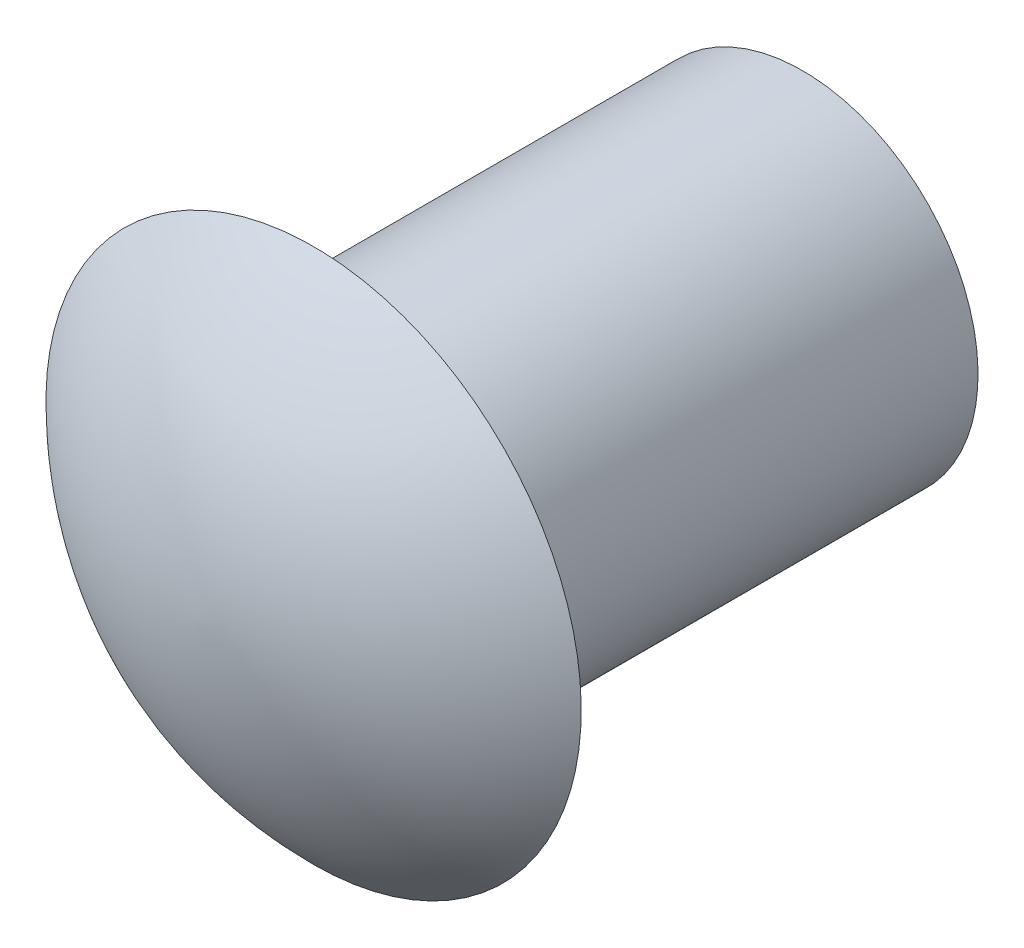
ISO-10303-21;
HEADER;
FILE_DESCRIPTION(('STEP AP214'),'2;1');
FILE_NAME('part.step','',(''),(''),'','','');
FILE_SCHEMA(('AUTOMOTIVE_DESIGN { 1 0 10303 214 1 1 1 1 }'));
ENDSEC;
DATA;
#1=APPLICATION_CONTEXT('core data for automotive mechanical design processes');
#2=APPLICATION_PROTOCOL_DEFINITION('international standard','automotive_design',2000,#1);
#3=PRODUCT_CONTEXT('',#1,'mechanical');
#4=PRODUCT('Part','Part','',(#3));
#5=PRODUCT_RELATED_PRODUCT_CATEGORY('part','',(#4));
#6=PRODUCT_DEFINITION_FORMATION('','',#4);
#7=PRODUCT_DEFINITION_CONTEXT('part definition',#1,'design');
#8=PRODUCT_DEFINITION('design','',#6,#7);
#9=PRODUCT_DEFINITION_SHAPE('','',#8);
#10=(LENGTH_UNIT() NAMED_UNIT(*) SI_UNIT(.MILLI.,.METRE.));
#11=(NAMED_UNIT(*) PLANE_ANGLE_UNIT() SI_UNIT($,.RADIAN.));
#12=(NAMED_UNIT(*) SI_UNIT($,.STERADIAN.) SOLID_ANGLE_UNIT());
#13=UNCERTAINTY_MEASURE_WITH_UNIT(LENGTH_MEASURE(1.E-05),#10,'distance_accuracy_value','');
#14=(GEOMETRIC_REPRESENTATION_CONTEXT(3) GLOBAL_UNCERTAINTY_ASSIGNED_CONTEXT((#13)) GLOBAL_UNIT_ASSIGNED_CONTEXT((#10,
#11,#12)) REPRESENTATION_CONTEXT('',''));
#15=CARTESIAN_POINT('',(0.,0.,0.));
#16=DIRECTION('',(0.,0.,1.));
#17=DIRECTION('',(1.,0.,0.));
#18=AXIS2_PLACEMENT_3D('',#15,#16,#17);
#19=CARTESIAN_POINT('',(0.,0.,-3.));
#20=DIRECTION('',(0.,0.,1.));
#21=DIRECTION('',(0.,1.,0.));
#22=AXIS2_PLACEMENT_3D('',#19,#20,#21);
#23=PLANE('',#22);
#24=CARTESIAN_POINT('',(0.,0.,-3.));
#25=DIRECTION('',(0.,0.,1.));
#26=DIRECTION('',(0.,-1.,0.));
#27=AXIS2_PLACEMENT_3D('',#24,#25,#26);
#28=CIRCLE('',#27,1.9);
#29=CARTESIAN_POINT('',(0.,-1.9,-3.));
#30=VERTEX_POINT('',#29);
#31=EDGE_CURVE('E11',#30,#30,#28,.T.);
#32=ORIENTED_EDGE('',*,*,#31,.F.);
#33=EDGE_LOOP('',(#32));
#34=FACE_BOUND('',#33,.T.);
#35=ADVANCED_FACE('F37',(#34),#23,.F.);
#36=CARTESIAN_POINT('',(0.,0.,-3.));
#37=DIRECTION('',(0.,0.,-1.));
#38=DIRECTION('',(0.,-1.,0.));
#39=AXIS2_PLACEMENT_3D('',#36,#37,#38);
#40=CYLINDRICAL_SURFACE('',#39,1.9);
#41=ORIENTED_EDGE('',*,*,#31,.T.);
#42=EDGE_LOOP('',(#41));
#43=FACE_BOUND('',#42,.T.);
#44=CARTESIAN_POINT('',(0.,0.,2.3));
#45=DIRECTION('',(0.,0.,1.));
#46=DIRECTION('',(0.,-1.,0.));
#47=AXIS2_PLACEMENT_3D('',#44,#45,#46);
#48=CIRCLE('',#47,1.9);
#49=CARTESIAN_POINT('',(0.,-1.9,2.3));
#50=VERTEX_POINT('',#49);
#51=EDGE_CURVE('E43',#50,#50,#48,.T.);
#52=ORIENTED_EDGE('',*,*,#51,.F.);
#53=EDGE_LOOP('',(#52));
#54=FACE_BOUND('',#53,.T.);
#55=ADVANCED_FACE('F54',(#43,#54),#40,.T.);
#56=CARTESIAN_POINT('',(0.,1.9,2.3));
#57=DIRECTION('',(0.,0.,1.));
#58=DIRECTION('',(0.,1.,0.));
#59=AXIS2_PLACEMENT_3D('',#56,#57,#58);
#60=PLANE('',#59);
#61=ORIENTED_EDGE('',*,*,#51,.T.);
#62=EDGE_LOOP('',(#61));
#63=FACE_BOUND('',#62,.T.);
#64=CARTESIAN_POINT('',(0.,0.,2.3));
#65=DIRECTION('',(0.,0.,1.));
#66=DIRECTION('',(0.,-1.,0.));
#67=AXIS2_PLACEMENT_3D('',#64,#65,#66);
#68=CIRCLE('',#67,2.9);
#69=CARTESIAN_POINT('',(0.,-2.9,2.3));
#70=VERTEX_POINT('',#69);
#71=EDGE_CURVE('E68',#70,#70,#68,.T.);
#72=ORIENTED_EDGE('',*,*,#71,.F.);
#73=EDGE_LOOP('',(#72));
#74=FACE_BOUND('',#73,.T.);
#75=ADVANCED_FACE('F48',(#63,#74),#60,.F.);
#76=CARTESIAN_POINT('',(0.,0.10120681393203,-0.698792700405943));
#77=DIRECTION('',(1.,0.,0.));
#78=DIRECTION('',(0.,-1.,0.));
#79=AXIS2_PLACEMENT_3D('',#76,#77,#78);
#80=CIRCLE('',#79,4.24264068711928);
#81=TRIMMED_CURVE('',#80,(PARAMETER_VALUE(-1.54693938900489)),
(PARAMETER_VALUE(1.54693938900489)),.T.,.PARAMETER.);
#82=CARTESIAN_POINT('',(0.,0.,-0.698792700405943));
#83=DIRECTION('',(0.,0.,-1.));
#84=AXIS1_PLACEMENT('',#82,#83);
#85=SURFACE_OF_REVOLUTION('',#81,#84);
#86=ORIENTED_EDGE('',*,*,#71,.T.);
#87=EDGE_LOOP('',(#86));
#88=FACE_BOUND('',#87,.T.);
#89=CARTESIAN_POINT('',(0.,0.,3.54264068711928));
#90=VERTEX_POINT('',#89);
#91=VERTEX_LOOP('',#90);
#92=FACE_BOUND('',#91,.T.);
#93=ADVANCED_FACE('F46',(#88,#92),#85,.T.);
#94=CLOSED_SHELL('',(#35,#55,#75,#93));
#95=MANIFOLD_SOLID_BREP('B2',#94);
#96=ADVANCED_BREP_SHAPE_REPRESENTATION('',(#18,#95),#14);
#97=SHAPE_DEFINITION_REPRESENTATION(#9,#96);
ENDSEC;
END-ISO-10303-21;
